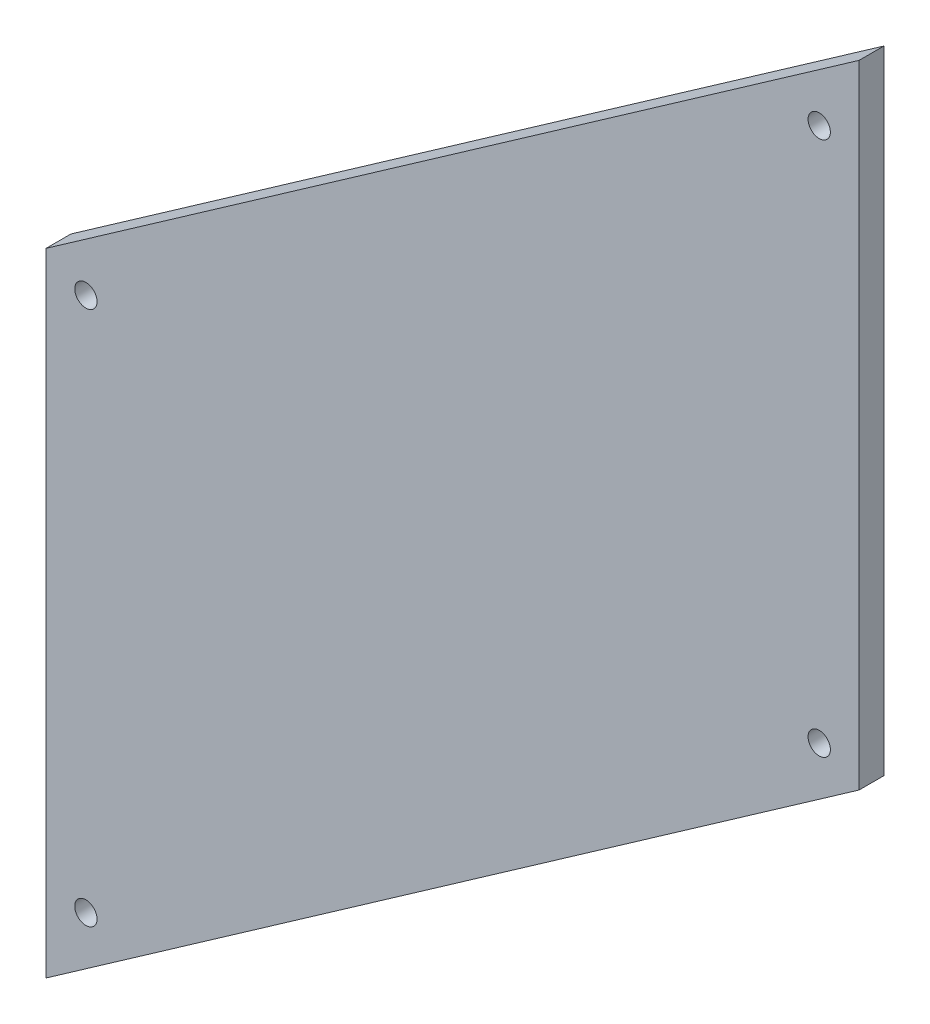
from build123d import *

# Parameters (mm, degrees)
SKETCH1_R           = 5.334
BOSS_EXTRUDE1_DEPTH = 11.90625


with BuildPart() as part:
    # Sketch1 → Boss-Extrude1 (new body)
    with BuildSketch(Plane.XY):
        Polygon((0, 0), (0, 302.324826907), (388.9375, 574.661796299), (388.9375, 272.336969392), align=None)
        with Locations((19.05, 292.408024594)):
            Circle(SKETCH1_R, mode=Mode.SUBTRACT)
        with Locations((19.05, 36.594709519)):
            Circle(SKETCH1_R, mode=Mode.SUBTRACT)
        with Locations((369.8875, 282.253771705)):
            Circle(SKETCH1_R, mode=Mode.SUBTRACT)
        with Locations((369.8875, 538.06708678)):
            Circle(SKETCH1_R, mode=Mode.SUBTRACT)
    extrude(amount=BOSS_EXTRUDE1_DEPTH)


solid = part.part
